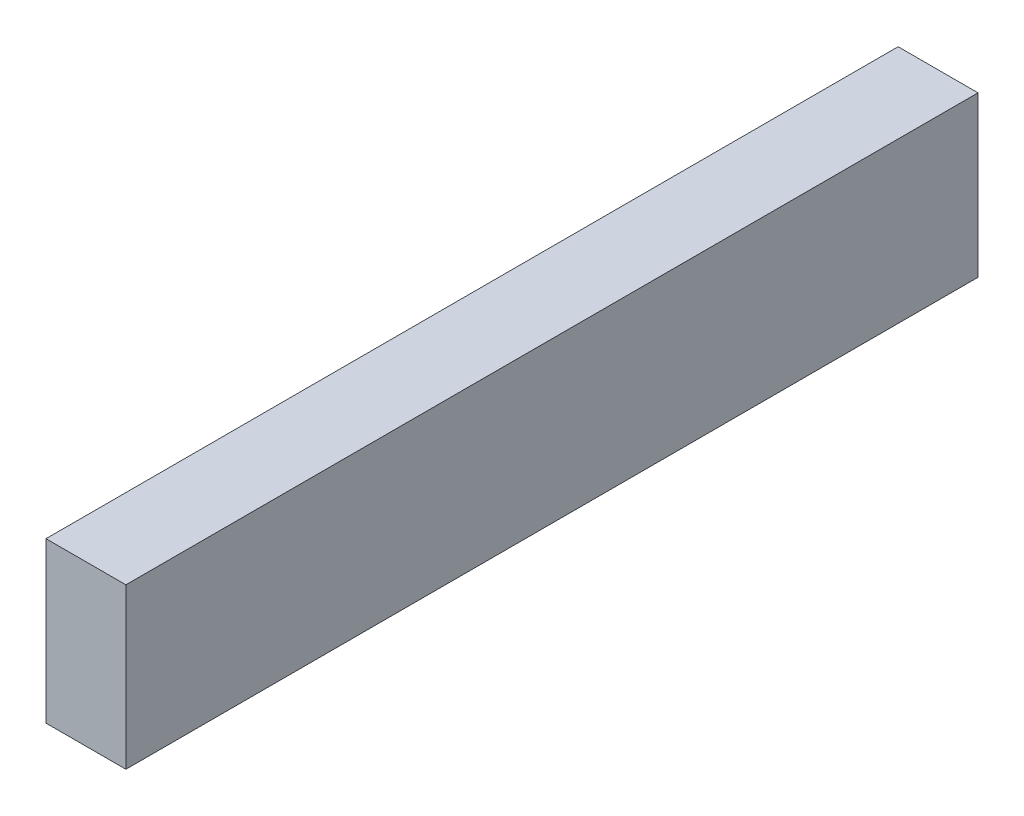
from build123d import *

# Parameters (mm, degrees)
ESQUISSE1_W      = 15
ESQUISSE1_H      = 30
EXTRUSION1_DEPTH = 160


with BuildPart() as part:
    # Esquisse1 → Extrusion1 (new body)
    with BuildSketch(Plane.XY):
        with Locations((7.5, 15)):
            Rectangle(ESQUISSE1_W, ESQUISSE1_H)
    extrude(amount=EXTRUSION1_DEPTH)


solid = part.part
